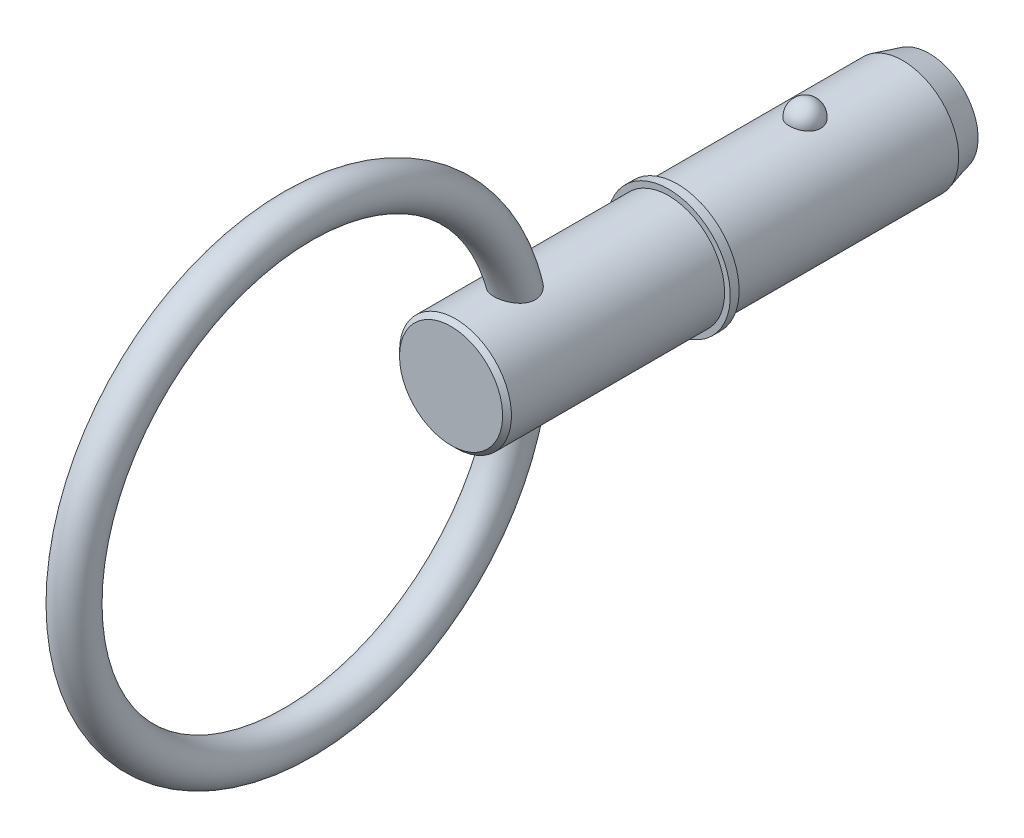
from build123d import *

# Parameters (mm, degrees)
SKETCH2_R           = 6.35
BOSS_EXTRUDE1_DEPTH = 12.7
BOSS_EXTRUDE2_START = 15.88
SKETCH3_R           = 6.35
BOSS_EXTRUDE2_DEPTH = 15.88
CHAMFER1_SIZE       = 3
CHAMFER1_SIZE2      = 0.803847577
SKETCH20_W          = 1
SKETCH20_H          = 7
SKETCH21_R          = 6.35
BOSS_EXTRUDE3_DEPTH = 25.7
CHAMFER2_SIZE       = 0.5
SKETCH24_R          = 2.25


with BuildPart() as part:
    # Sketch2 → Boss-Extrude1 (new body)
    with BuildSketch(Plane.XY):
        Circle(SKETCH2_R)
    extrude(amount=BOSS_EXTRUDE1_DEPTH)

    # Sketch3 → Boss-Extrude2 (add)
    with BuildSketch(Plane(origin=(0, 0, 0), x_dir=(-1, 0, 0), z_dir=(0, 0, -1)).offset(BOSS_EXTRUDE2_START)):
        Circle(SKETCH3_R)
    extrude(amount=-BOSS_EXTRUDE2_DEPTH)

    # Chamfer1
    chamfer1_edges = [part.edges().sort_by_distance(p)[0] for p in [
        (6.35, 0, -15.88),
    ]]
    chamfer1_side = [part.faces().sort_by_distance(p)[0] for p in [
        (6.35, 0, -7.94),
    ]]
    chamfer(chamfer1_edges, length=CHAMFER1_SIZE, length2=CHAMFER1_SIZE2, reference=chamfer1_side[0])

    # Sketch18 → Revolve1 (revolve)
    with BuildSketch(Plane(origin=(0, 0, 0), x_dir=(0, 0, -1), z_dir=(1, 0, 0))):
        with BuildLine():
            Line((1.78, 8.13), (1.78, 4.57))
            ThreePointArc((1.78, 4.57), (0, 6.35), (1.78, 8.13))
        make_face()
    revolve(axis=Axis((0, 8.13, -1.78), (0, -1, 0)))

    # Sketch20 → Revolve2 (revolve)
    with BuildSketch(Plane(origin=(0, 0, 0), x_dir=(0, 0, -1), z_dir=(1, 0, 0)), mode=Mode.PRIVATE) as revolve2_sk:
        with Locations((-13.2, 3.5)):
            Rectangle(SKETCH20_W, SKETCH20_H)
    revolve(revolve2_sk.sketch.rotate(Axis((0, 0, 33.728787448), (0, 0, 1)), 90), axis=Axis((0, 0, 33.728787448), (0, 0, 1)))

    # Sketch21 → Boss-Extrude3 (add)
    with BuildSketch(Plane(origin=(0, 0, 12.7), x_dir=(-1, 0, 0), z_dir=(0, 0, -1))):
        Circle(SKETCH21_R)
    extrude(amount=-BOSS_EXTRUDE3_DEPTH)

    # Chamfer2
    chamfer2_edges = [part.edges().sort_by_distance(p)[0] for p in [
        (6.35, 0, 38.4),
    ]]
    chamfer(chamfer2_edges, length=CHAMFER2_SIZE)

    # Sweep1: sweep along a path in Sketch23
    with BuildLine(Plane(origin=(0, 0, 0), x_dir=(0, 0, -1), z_dir=(1, 0, 0))) as sweep1_path:
        CenterArc((-55.8, 0), 25.4, 0, 360)
    # Sketch24 → Sweep1 (sweep)
    with BuildSketch(Plane(origin=(0, 0, 0), x_dir=(1, 0, 0), z_dir=(0, 1, 0))):
        with Locations((0, -30.4)):
            Circle(SKETCH24_R)
    sweep(path=sweep1_path.line)


solid = part.part
